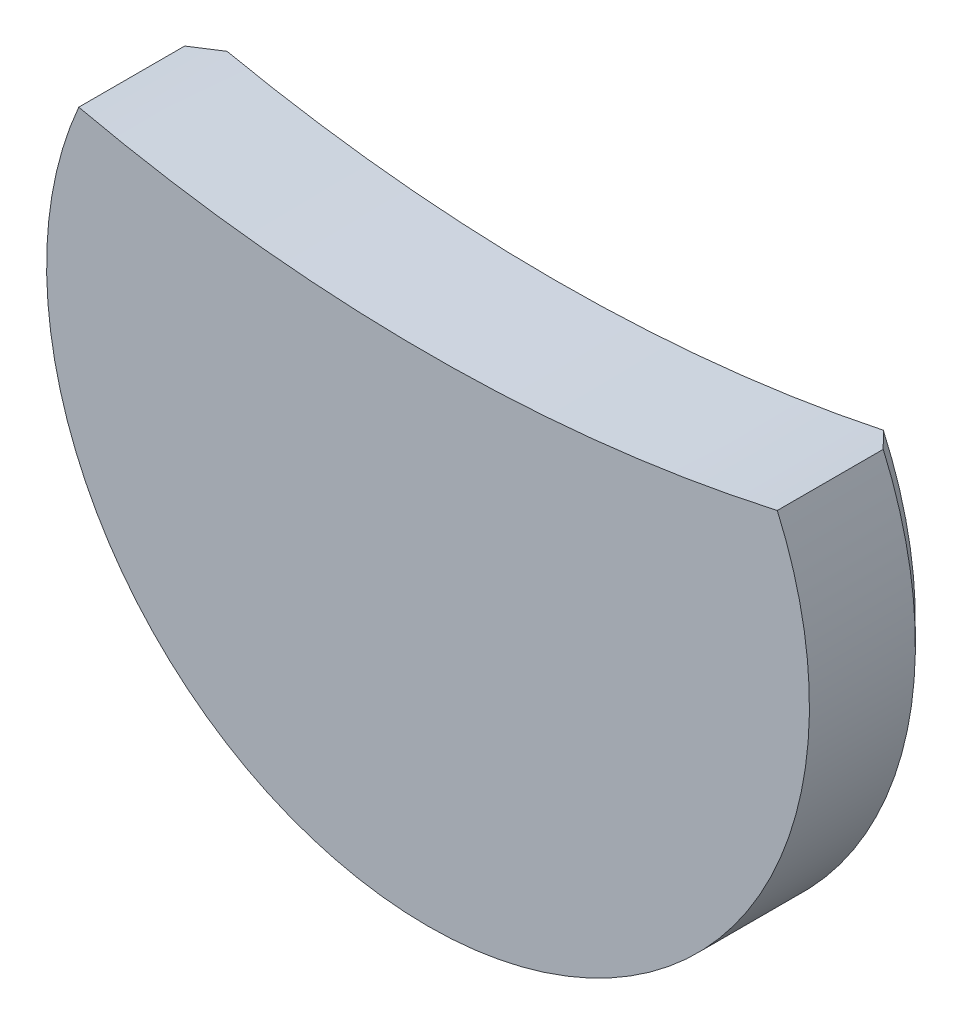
from build123d import *

# Parameters (mm, degrees)
BOSS_EXTRUDE1_DEPTH = 3
CHAMFER1_SIZE       = 0.5


with BuildPart() as part:
    # Sketch2 → Boss-Extrude1 (new body)
    with BuildSketch(Plane.XY):
        with BuildLine():
            ThreePointArc((-8.241287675, 3.616791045), (0, -9), (8.241287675, 3.616791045))
            ThreePointArc((8.241287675, 3.616791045), (0, 2.7), (-8.241287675, 3.616791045))
        make_face()
    extrude(amount=BOSS_EXTRUDE1_DEPTH)

    # Chamfer1
    chamfer1_edges = [part.edges().sort_by_distance(p)[0] for p in [
        (0, -9, 0),
    ]]
    chamfer(chamfer1_edges, length=CHAMFER1_SIZE)


solid = part.part
